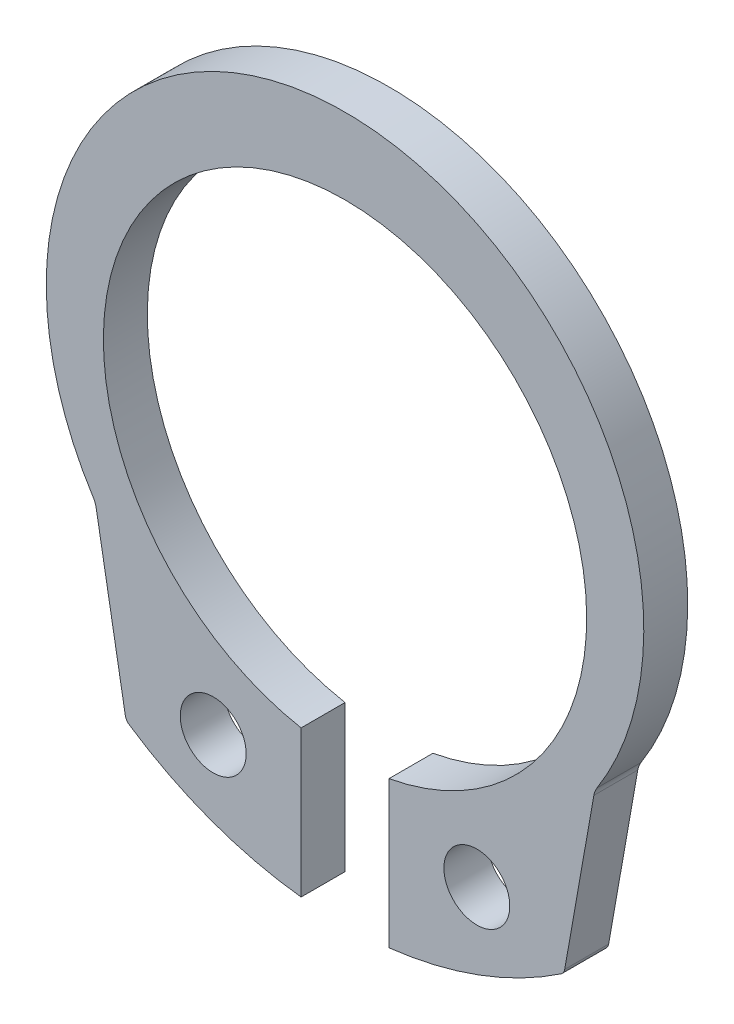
ISO-10303-21;
HEADER;
FILE_DESCRIPTION(('STEP AP214'),'2;1');
FILE_NAME('part.step','',(''),(''),'','','');
FILE_SCHEMA(('AUTOMOTIVE_DESIGN { 1 0 10303 214 1 1 1 1 }'));
ENDSEC;
DATA;
#1=APPLICATION_CONTEXT('core data for automotive mechanical design processes');
#2=APPLICATION_PROTOCOL_DEFINITION('international standard','automotive_design',2000,#1);
#3=PRODUCT_CONTEXT('',#1,'mechanical');
#4=PRODUCT('Part','Part','',(#3));
#5=PRODUCT_RELATED_PRODUCT_CATEGORY('part','',(#4));
#6=PRODUCT_DEFINITION_FORMATION('','',#4);
#7=PRODUCT_DEFINITION_CONTEXT('part definition',#1,'design');
#8=PRODUCT_DEFINITION('design','',#6,#7);
#9=PRODUCT_DEFINITION_SHAPE('','',#8);
#10=(LENGTH_UNIT() NAMED_UNIT(*) SI_UNIT(.MILLI.,.METRE.));
#11=(NAMED_UNIT(*) PLANE_ANGLE_UNIT() SI_UNIT($,.RADIAN.));
#12=(NAMED_UNIT(*) SI_UNIT($,.STERADIAN.) SOLID_ANGLE_UNIT());
#13=UNCERTAINTY_MEASURE_WITH_UNIT(LENGTH_MEASURE(1.E-05),#10,'distance_accuracy_value','');
#14=(GEOMETRIC_REPRESENTATION_CONTEXT(3) GLOBAL_UNCERTAINTY_ASSIGNED_CONTEXT((#13)) GLOBAL_UNIT_ASSIGNED_CONTEXT((#10,
#11,#12)) REPRESENTATION_CONTEXT('',''));
#15=CARTESIAN_POINT('',(0.,0.,0.));
#16=DIRECTION('',(0.,0.,1.));
#17=DIRECTION('',(1.,0.,0.));
#18=AXIS2_PLACEMENT_3D('',#15,#16,#17);
#19=CARTESIAN_POINT('',(-6.1556142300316,-3.92408122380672,0.5));
#20=DIRECTION('',(0.,0.,1.));
#21=DIRECTION('',(1.,0.,0.));
#22=AXIS2_PLACEMENT_3D('',#19,#20,#21);
#23=PLANE('',#22);
#24=CARTESIAN_POINT('',(-3.,-6.97522726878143,0.5));
#25=DIRECTION('',(0.,0.,1.));
#26=DIRECTION('',(1.,0.,0.));
#27=AXIS2_PLACEMENT_3D('',#24,#25,#26);
#28=CIRCLE('',#27,0.75);
#29=CARTESIAN_POINT('',(-2.25,-6.97522726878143,0.5));
#30=VERTEX_POINT('',#29);
#31=EDGE_CURVE('E188',#30,#30,#28,.T.);
#32=ORIENTED_EDGE('',*,*,#31,.F.);
#33=EDGE_LOOP('',(#32));
#34=FACE_BOUND('',#33,.T.);
#35=CARTESIAN_POINT('',(-6.1556142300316,-3.92408122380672,0.5));
#36=DIRECTION('',(0.,0.,-1.));
#37=DIRECTION('',(1.,0.,0.));
#38=AXIS2_PLACEMENT_3D('',#35,#36,#37);
#39=CIRCLE('',#38,0.5);
#40=CARTESIAN_POINT('',(-5.73399681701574,-3.65530853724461,0.5));
#41=VERTEX_POINT('',#40);
#42=CARTESIAN_POINT('',(-5.6632103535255,-3.83725713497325,0.5));
#43=VERTEX_POINT('',#42);
#44=EDGE_CURVE('E191',#41,#43,#39,.T.);
#45=ORIENTED_EDGE('',*,*,#44,.T.);
#46=DIRECTION('',(0.173648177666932,-0.984807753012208,0.));
#47=VECTOR('',#46,1.);
#48=CARTESIAN_POINT('',(-5.6632103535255,-3.83725713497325,0.5));
#49=LINE('',#48,#47);
#50=CARTESIAN_POINT('',(-5.,-7.59850995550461,0.5));
#51=VERTEX_POINT('',#50);
#52=EDGE_CURVE('E133',#43,#51,#49,.T.);
#53=ORIENTED_EDGE('',*,*,#52,.T.);
#54=CARTESIAN_POINT('',(-4.80303844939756,-7.56378031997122,0.5));
#55=DIRECTION('',(0.,0.,1.));
#56=DIRECTION('',(-1.,0.,0.));
#57=AXIS2_PLACEMENT_3D('',#54,#55,#56);
#58=CIRCLE('',#57,0.2);
#59=CARTESIAN_POINT('',(-4.9147370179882,-7.72968218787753,0.5));
#60=VERTEX_POINT('',#59);
#61=EDGE_CURVE('E194',#51,#60,#58,.T.);
#62=ORIENTED_EDGE('',*,*,#61,.T.);
#63=CARTESIAN_POINT('',(0.,-0.43,0.5));
#64=DIRECTION('',(0.,0.,1.));
#65=DIRECTION('',(-1.,0.,0.));
#66=AXIS2_PLACEMENT_3D('',#63,#64,#65);
#67=CIRCLE('',#66,8.8);
#68=CARTESIAN_POINT('',(-0.999999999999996,-9.17299719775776,0.5));
#69=VERTEX_POINT('',#68);
#70=EDGE_CURVE('E196',#60,#69,#67,.T.);
#71=ORIENTED_EDGE('',*,*,#70,.T.);
#72=DIRECTION('',(0.,1.,0.));
#73=VECTOR('',#72,1.);
#74=CARTESIAN_POINT('',(-1.,-5.83832691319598,0.5));
#75=LINE('',#74,#73);
#76=CARTESIAN_POINT('',(-1.,-5.83832691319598,0.5));
#77=VERTEX_POINT('',#76);
#78=EDGE_CURVE('E198',#69,#77,#75,.T.);
#79=ORIENTED_EDGE('',*,*,#78,.T.);
#80=CARTESIAN_POINT('',(0.,-0.43,0.5));
#81=DIRECTION('',(0.,0.,-1.));
#82=DIRECTION('',(1.,0.,0.));
#83=AXIS2_PLACEMENT_3D('',#80,#81,#82);
#84=CIRCLE('',#83,5.5);
#85=CARTESIAN_POINT('',(0.999999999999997,-5.83832691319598,0.5));
#86=VERTEX_POINT('',#85);
#87=EDGE_CURVE('E200',#77,#86,#84,.T.);
#88=ORIENTED_EDGE('',*,*,#87,.T.);
#89=DIRECTION('',(0.,-1.,0.));
#90=VECTOR('',#89,1.);
#91=CARTESIAN_POINT('',(1.,-5.83832691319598,0.5));
#92=LINE('',#91,#90);
#93=CARTESIAN_POINT('',(1.,-9.17299719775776,0.5));
#94=VERTEX_POINT('',#93);
#95=EDGE_CURVE('E202',#86,#94,#92,.T.);
#96=ORIENTED_EDGE('',*,*,#95,.T.);
#97=CARTESIAN_POINT('',(0.,-0.43,0.5));
#98=DIRECTION('',(0.,0.,1.));
#99=DIRECTION('',(1.,0.,0.));
#100=AXIS2_PLACEMENT_3D('',#97,#98,#99);
#101=CIRCLE('',#100,8.8);
#102=CARTESIAN_POINT('',(4.9147370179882,-7.72968218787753,0.5));
#103=VERTEX_POINT('',#102);
#104=EDGE_CURVE('E204',#94,#103,#101,.T.);
#105=ORIENTED_EDGE('',*,*,#104,.T.);
#106=CARTESIAN_POINT('',(4.80303844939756,-7.56378031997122,0.5));
#107=DIRECTION('',(0.,0.,1.));
#108=DIRECTION('',(1.,0.,0.));
#109=AXIS2_PLACEMENT_3D('',#106,#107,#108);
#110=CIRCLE('',#109,0.2);
#111=CARTESIAN_POINT('',(5.,-7.59850995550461,0.5));
#112=VERTEX_POINT('',#111);
#113=EDGE_CURVE('E206',#103,#112,#110,.T.);
#114=ORIENTED_EDGE('',*,*,#113,.T.);
#115=DIRECTION('',(0.173648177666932,0.984807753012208,0.));
#116=VECTOR('',#115,1.);
#117=CARTESIAN_POINT('',(5.6632103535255,-3.83725713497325,0.5));
#118=LINE('',#117,#116);
#119=CARTESIAN_POINT('',(5.6632103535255,-3.83725713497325,0.5));
#120=VERTEX_POINT('',#119);
#121=EDGE_CURVE('E208',#112,#120,#118,.T.);
#122=ORIENTED_EDGE('',*,*,#121,.T.);
#123=CARTESIAN_POINT('',(6.1556142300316,-3.92408122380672,0.5));
#124=DIRECTION('',(0.,0.,-1.));
#125=DIRECTION('',(-1.,0.,0.));
#126=AXIS2_PLACEMENT_3D('',#123,#124,#125);
#127=CIRCLE('',#126,0.5);
#128=CARTESIAN_POINT('',(5.73399681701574,-3.65530853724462,0.5));
#129=VERTEX_POINT('',#128);
#130=EDGE_CURVE('E61',#120,#129,#127,.T.);
#131=ORIENTED_EDGE('',*,*,#130,.T.);
#132=CARTESIAN_POINT('',(0.,0.,0.5));
#133=DIRECTION('',(0.,0.,1.));
#134=DIRECTION('',(1.,0.,0.));
#135=AXIS2_PLACEMENT_3D('',#132,#133,#134);
#136=CIRCLE('',#135,6.8);
#137=EDGE_CURVE('E56',#129,#41,#136,.T.);
#138=ORIENTED_EDGE('',*,*,#137,.T.);
#139=EDGE_LOOP('',(#45,#53,#62,#71,#79,#88,#96,#105,#114,#122,#131,#138));
#140=FACE_BOUND('',#139,.T.);
#141=CARTESIAN_POINT('',(3.,-6.97522726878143,0.5));
#142=DIRECTION('',(0.,0.,1.));
#143=DIRECTION('',(-1.,0.,0.));
#144=AXIS2_PLACEMENT_3D('',#141,#142,#143);
#145=CIRCLE('',#144,0.75);
#146=CARTESIAN_POINT('',(2.25,-6.97522726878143,0.5));
#147=VERTEX_POINT('',#146);
#148=EDGE_CURVE('E185',#147,#147,#145,.T.);
#149=ORIENTED_EDGE('',*,*,#148,.F.);
#150=EDGE_LOOP('',(#149));
#151=FACE_BOUND('',#150,.T.);
#152=ADVANCED_FACE('F41',(#34,#140,#151),#23,.T.);
#153=CARTESIAN_POINT('',(-6.1556142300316,-3.92408122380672,0.5));
#154=DIRECTION('',(0.,0.,-1.));
#155=DIRECTION('',(-1.,0.,0.));
#156=AXIS2_PLACEMENT_3D('',#153,#154,#155);
#157=CYLINDRICAL_SURFACE('',#156,0.5);
#158=DIRECTION('',(0.,0.,-1.));
#159=VECTOR('',#158,1.);
#160=CARTESIAN_POINT('',(-5.73399681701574,-3.65530853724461,0.5));
#161=LINE('',#160,#159);
#162=CARTESIAN_POINT('',(-5.73399681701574,-3.65530853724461,-0.5));
#163=VERTEX_POINT('',#162);
#164=EDGE_CURVE('E148',#41,#163,#161,.T.);
#165=ORIENTED_EDGE('',*,*,#164,.T.);
#166=CARTESIAN_POINT('',(-6.1556142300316,-3.92408122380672,-0.5));
#167=DIRECTION('',(0.,0.,-1.));
#168=DIRECTION('',(1.,0.,0.));
#169=AXIS2_PLACEMENT_3D('',#166,#167,#168);
#170=CIRCLE('',#169,0.5);
#171=CARTESIAN_POINT('',(-5.6632103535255,-3.83725713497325,-0.5));
#172=VERTEX_POINT('',#171);
#173=EDGE_CURVE('E142',#163,#172,#170,.T.);
#174=ORIENTED_EDGE('',*,*,#173,.T.);
#175=DIRECTION('',(0.,0.,-1.));
#176=VECTOR('',#175,1.);
#177=CARTESIAN_POINT('',(-5.6632103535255,-3.83725713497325,0.5));
#178=LINE('',#177,#176);
#179=EDGE_CURVE('E11',#43,#172,#178,.T.);
#180=ORIENTED_EDGE('',*,*,#179,.F.);
#181=ORIENTED_EDGE('',*,*,#44,.F.);
#182=EDGE_LOOP('',(#165,#174,#180,#181));
#183=FACE_BOUND('',#182,.T.);
#184=ADVANCED_FACE('F43',(#183),#157,.F.);
#185=CARTESIAN_POINT('',(-5.6632103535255,-3.83725713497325,0.5));
#186=DIRECTION('',(0.984807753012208,0.173648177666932,0.));
#187=DIRECTION('',(-0.173648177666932,0.984807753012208,0.));
#188=AXIS2_PLACEMENT_3D('',#185,#186,#187);
#189=PLANE('',#188);
#190=ORIENTED_EDGE('',*,*,#179,.T.);
#191=DIRECTION('',(0.173648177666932,-0.984807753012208,0.));
#192=VECTOR('',#191,1.);
#193=CARTESIAN_POINT('',(-5.6632103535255,-3.83725713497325,-0.5));
#194=LINE('',#193,#192);
#195=CARTESIAN_POINT('',(-5.,-7.59850995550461,-0.5));
#196=VERTEX_POINT('',#195);
#197=EDGE_CURVE('E132',#172,#196,#194,.T.);
#198=ORIENTED_EDGE('',*,*,#197,.T.);
#199=DIRECTION('',(0.,0.,-1.));
#200=VECTOR('',#199,1.);
#201=CARTESIAN_POINT('',(-5.,-7.59850995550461,0.5));
#202=LINE('',#201,#200);
#203=EDGE_CURVE('E49',#51,#196,#202,.T.);
#204=ORIENTED_EDGE('',*,*,#203,.F.);
#205=ORIENTED_EDGE('',*,*,#52,.F.);
#206=EDGE_LOOP('',(#190,#198,#204,#205));
#207=FACE_BOUND('',#206,.T.);
#208=ADVANCED_FACE('F130',(#207),#189,.F.);
#209=CARTESIAN_POINT('',(-4.80303844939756,-7.56378031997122,0.5));
#210=DIRECTION('',(0.,0.,-1.));
#211=DIRECTION('',(-1.,0.,0.));
#212=AXIS2_PLACEMENT_3D('',#209,#210,#211);
#213=CYLINDRICAL_SURFACE('',#212,0.2);
#214=ORIENTED_EDGE('',*,*,#203,.T.);
#215=CARTESIAN_POINT('',(-4.80303844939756,-7.56378031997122,-0.5));
#216=DIRECTION('',(0.,0.,1.));
#217=DIRECTION('',(-1.,0.,0.));
#218=AXIS2_PLACEMENT_3D('',#215,#216,#217);
#219=CIRCLE('',#218,0.2);
#220=CARTESIAN_POINT('',(-4.9147370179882,-7.72968218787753,-0.5));
#221=VERTEX_POINT('',#220);
#222=EDGE_CURVE('E146',#196,#221,#219,.T.);
#223=ORIENTED_EDGE('',*,*,#222,.T.);
#224=DIRECTION('',(0.,0.,-1.));
#225=VECTOR('',#224,1.);
#226=CARTESIAN_POINT('',(-4.9147370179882,-7.72968218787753,0.5));
#227=LINE('',#226,#225);
#228=EDGE_CURVE('E230',#60,#221,#227,.T.);
#229=ORIENTED_EDGE('',*,*,#228,.F.);
#230=ORIENTED_EDGE('',*,*,#61,.F.);
#231=EDGE_LOOP('',(#214,#223,#229,#230));
#232=FACE_BOUND('',#231,.T.);
#233=ADVANCED_FACE('F233',(#232),#213,.T.);
#234=CARTESIAN_POINT('',(0.,-0.43,0.5));
#235=DIRECTION('',(0.,0.,-1.));
#236=DIRECTION('',(-1.,0.,0.));
#237=AXIS2_PLACEMENT_3D('',#234,#235,#236);
#238=CYLINDRICAL_SURFACE('',#237,8.8);
#239=ORIENTED_EDGE('',*,*,#228,.T.);
#240=CARTESIAN_POINT('',(0.,-0.43,-0.5));
#241=DIRECTION('',(0.,0.,1.));
#242=DIRECTION('',(-1.,0.,0.));
#243=AXIS2_PLACEMENT_3D('',#240,#241,#242);
#244=CIRCLE('',#243,8.8);
#245=CARTESIAN_POINT('',(-0.999999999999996,-9.17299719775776,-0.5));
#246=VERTEX_POINT('',#245);
#247=EDGE_CURVE('E157',#221,#246,#244,.T.);
#248=ORIENTED_EDGE('',*,*,#247,.T.);
#249=DIRECTION('',(0.,0.,-1.));
#250=VECTOR('',#249,1.);
#251=CARTESIAN_POINT('',(-0.999999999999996,-9.17299719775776,0.5));
#252=LINE('',#251,#250);
#253=EDGE_CURVE('E228',#69,#246,#252,.T.);
#254=ORIENTED_EDGE('',*,*,#253,.F.);
#255=ORIENTED_EDGE('',*,*,#70,.F.);
#256=EDGE_LOOP('',(#239,#248,#254,#255));
#257=FACE_BOUND('',#256,.T.);
#258=ADVANCED_FACE('F241',(#257),#238,.T.);
#259=CARTESIAN_POINT('',(-1.,-5.83832691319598,0.5));
#260=DIRECTION('',(-1.,0.,0.));
#261=DIRECTION('',(0.,-1.,0.));
#262=AXIS2_PLACEMENT_3D('',#259,#260,#261);
#263=PLANE('',#262);
#264=ORIENTED_EDGE('',*,*,#253,.T.);
#265=DIRECTION('',(0.,1.,0.));
#266=VECTOR('',#265,1.);
#267=CARTESIAN_POINT('',(-1.,-5.83832691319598,-0.5));
#268=LINE('',#267,#266);
#269=CARTESIAN_POINT('',(-1.,-5.83832691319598,-0.5));
#270=VERTEX_POINT('',#269);
#271=EDGE_CURVE('E160',#246,#270,#268,.T.);
#272=ORIENTED_EDGE('',*,*,#271,.T.);
#273=DIRECTION('',(0.,0.,-1.));
#274=VECTOR('',#273,1.);
#275=CARTESIAN_POINT('',(-1.,-5.83832691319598,0.5));
#276=LINE('',#275,#274);
#277=EDGE_CURVE('E226',#77,#270,#276,.T.);
#278=ORIENTED_EDGE('',*,*,#277,.F.);
#279=ORIENTED_EDGE('',*,*,#78,.F.);
#280=EDGE_LOOP('',(#264,#272,#278,#279));
#281=FACE_BOUND('',#280,.T.);
#282=ADVANCED_FACE('F244',(#281),#263,.F.);
#283=CARTESIAN_POINT('',(0.,-0.43,0.5));
#284=DIRECTION('',(0.,0.,-1.));
#285=DIRECTION('',(-1.,0.,0.));
#286=AXIS2_PLACEMENT_3D('',#283,#284,#285);
#287=CYLINDRICAL_SURFACE('',#286,5.5);
#288=ORIENTED_EDGE('',*,*,#277,.T.);
#289=CARTESIAN_POINT('',(0.,-0.43,-0.5));
#290=DIRECTION('',(0.,0.,-1.));
#291=DIRECTION('',(1.,0.,0.));
#292=AXIS2_PLACEMENT_3D('',#289,#290,#291);
#293=CIRCLE('',#292,5.5);
#294=CARTESIAN_POINT('',(0.999999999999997,-5.83832691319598,-0.5));
#295=VERTEX_POINT('',#294);
#296=EDGE_CURVE('E163',#270,#295,#293,.T.);
#297=ORIENTED_EDGE('',*,*,#296,.T.);
#298=DIRECTION('',(0.,0.,-1.));
#299=VECTOR('',#298,1.);
#300=CARTESIAN_POINT('',(0.999999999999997,-5.83832691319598,0.5));
#301=LINE('',#300,#299);
#302=EDGE_CURVE('E224',#86,#295,#301,.T.);
#303=ORIENTED_EDGE('',*,*,#302,.F.);
#304=ORIENTED_EDGE('',*,*,#87,.F.);
#305=EDGE_LOOP('',(#288,#297,#303,#304));
#306=FACE_BOUND('',#305,.T.);
#307=ADVANCED_FACE('F249',(#306),#287,.F.);
#308=CARTESIAN_POINT('',(1.,-5.83832691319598,0.5));
#309=DIRECTION('',(1.,0.,0.));
#310=DIRECTION('',(0.,1.,0.));
#311=AXIS2_PLACEMENT_3D('',#308,#309,#310);
#312=PLANE('',#311);
#313=ORIENTED_EDGE('',*,*,#302,.T.);
#314=DIRECTION('',(0.,-1.,0.));
#315=VECTOR('',#314,1.);
#316=CARTESIAN_POINT('',(1.,-5.83832691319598,-0.5));
#317=LINE('',#316,#315);
#318=CARTESIAN_POINT('',(1.,-9.17299719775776,-0.5));
#319=VERTEX_POINT('',#318);
#320=EDGE_CURVE('E167',#295,#319,#317,.T.);
#321=ORIENTED_EDGE('',*,*,#320,.T.);
#322=DIRECTION('',(0.,0.,-1.));
#323=VECTOR('',#322,1.);
#324=CARTESIAN_POINT('',(1.,-9.17299719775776,0.5));
#325=LINE('',#324,#323);
#326=EDGE_CURVE('E222',#94,#319,#325,.T.);
#327=ORIENTED_EDGE('',*,*,#326,.F.);
#328=ORIENTED_EDGE('',*,*,#95,.F.);
#329=EDGE_LOOP('',(#313,#321,#327,#328));
#330=FACE_BOUND('',#329,.T.);
#331=ADVANCED_FACE('F255',(#330),#312,.F.);
#332=CARTESIAN_POINT('',(0.,-0.43,0.5));
#333=DIRECTION('',(0.,0.,-1.));
#334=DIRECTION('',(-1.,0.,0.));
#335=AXIS2_PLACEMENT_3D('',#332,#333,#334);
#336=CYLINDRICAL_SURFACE('',#335,8.8);
#337=ORIENTED_EDGE('',*,*,#326,.T.);
#338=CARTESIAN_POINT('',(0.,-0.43,-0.5));
#339=DIRECTION('',(0.,0.,1.));
#340=DIRECTION('',(1.,0.,0.));
#341=AXIS2_PLACEMENT_3D('',#338,#339,#340);
#342=CIRCLE('',#341,8.8);
#343=CARTESIAN_POINT('',(4.9147370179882,-7.72968218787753,-0.5));
#344=VERTEX_POINT('',#343);
#345=EDGE_CURVE('E170',#319,#344,#342,.T.);
#346=ORIENTED_EDGE('',*,*,#345,.T.);
#347=DIRECTION('',(0.,0.,-1.));
#348=VECTOR('',#347,1.);
#349=CARTESIAN_POINT('',(4.9147370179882,-7.72968218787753,0.5));
#350=LINE('',#349,#348);
#351=EDGE_CURVE('E220',#103,#344,#350,.T.);
#352=ORIENTED_EDGE('',*,*,#351,.F.);
#353=ORIENTED_EDGE('',*,*,#104,.F.);
#354=EDGE_LOOP('',(#337,#346,#352,#353));
#355=FACE_BOUND('',#354,.T.);
#356=ADVANCED_FACE('F259',(#355),#336,.T.);
#357=CARTESIAN_POINT('',(4.80303844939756,-7.56378031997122,0.5));
#358=DIRECTION('',(0.,0.,-1.));
#359=DIRECTION('',(-1.,0.,0.));
#360=AXIS2_PLACEMENT_3D('',#357,#358,#359);
#361=CYLINDRICAL_SURFACE('',#360,0.2);
#362=ORIENTED_EDGE('',*,*,#351,.T.);
#363=CARTESIAN_POINT('',(4.80303844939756,-7.56378031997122,-0.5));
#364=DIRECTION('',(0.,0.,1.));
#365=DIRECTION('',(1.,0.,0.));
#366=AXIS2_PLACEMENT_3D('',#363,#364,#365);
#367=CIRCLE('',#366,0.2);
#368=CARTESIAN_POINT('',(5.,-7.59850995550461,-0.5));
#369=VERTEX_POINT('',#368);
#370=EDGE_CURVE('E173',#344,#369,#367,.T.);
#371=ORIENTED_EDGE('',*,*,#370,.T.);
#372=DIRECTION('',(0.,0.,-1.));
#373=VECTOR('',#372,1.);
#374=CARTESIAN_POINT('',(5.,-7.59850995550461,0.5));
#375=LINE('',#374,#373);
#376=EDGE_CURVE('E218',#112,#369,#375,.T.);
#377=ORIENTED_EDGE('',*,*,#376,.F.);
#378=ORIENTED_EDGE('',*,*,#113,.F.);
#379=EDGE_LOOP('',(#362,#371,#377,#378));
#380=FACE_BOUND('',#379,.T.);
#381=ADVANCED_FACE('F264',(#380),#361,.T.);
#382=CARTESIAN_POINT('',(5.6632103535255,-3.83725713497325,0.5));
#383=DIRECTION('',(-0.984807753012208,0.173648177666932,0.));
#384=DIRECTION('',(-0.173648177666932,-0.984807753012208,0.));
#385=AXIS2_PLACEMENT_3D('',#382,#383,#384);
#386=PLANE('',#385);
#387=ORIENTED_EDGE('',*,*,#376,.T.);
#388=DIRECTION('',(0.173648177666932,0.984807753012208,0.));
#389=VECTOR('',#388,1.);
#390=CARTESIAN_POINT('',(5.6632103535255,-3.83725713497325,-0.5));
#391=LINE('',#390,#389);
#392=CARTESIAN_POINT('',(5.6632103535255,-3.83725713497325,-0.5));
#393=VERTEX_POINT('',#392);
#394=EDGE_CURVE('E176',#369,#393,#391,.T.);
#395=ORIENTED_EDGE('',*,*,#394,.T.);
#396=DIRECTION('',(0.,0.,-1.));
#397=VECTOR('',#396,1.);
#398=CARTESIAN_POINT('',(5.6632103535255,-3.83725713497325,0.5));
#399=LINE('',#398,#397);
#400=EDGE_CURVE('E216',#120,#393,#399,.T.);
#401=ORIENTED_EDGE('',*,*,#400,.F.);
#402=ORIENTED_EDGE('',*,*,#121,.F.);
#403=EDGE_LOOP('',(#387,#395,#401,#402));
#404=FACE_BOUND('',#403,.T.);
#405=ADVANCED_FACE('F268',(#404),#386,.F.);
#406=CARTESIAN_POINT('',(6.1556142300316,-3.92408122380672,0.5));
#407=DIRECTION('',(0.,0.,-1.));
#408=DIRECTION('',(-1.,0.,0.));
#409=AXIS2_PLACEMENT_3D('',#406,#407,#408);
#410=CYLINDRICAL_SURFACE('',#409,0.5);
#411=ORIENTED_EDGE('',*,*,#400,.T.);
#412=CARTESIAN_POINT('',(6.1556142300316,-3.92408122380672,-0.5));
#413=DIRECTION('',(0.,0.,-1.));
#414=DIRECTION('',(-1.,0.,0.));
#415=AXIS2_PLACEMENT_3D('',#412,#413,#414);
#416=CIRCLE('',#415,0.5);
#417=CARTESIAN_POINT('',(5.73399681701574,-3.65530853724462,-0.5));
#418=VERTEX_POINT('',#417);
#419=EDGE_CURVE('E179',#393,#418,#416,.T.);
#420=ORIENTED_EDGE('',*,*,#419,.T.);
#421=DIRECTION('',(0.,0.,-1.));
#422=VECTOR('',#421,1.);
#423=CARTESIAN_POINT('',(5.73399681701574,-3.65530853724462,0.5));
#424=LINE('',#423,#422);
#425=EDGE_CURVE('E214',#129,#418,#424,.T.);
#426=ORIENTED_EDGE('',*,*,#425,.F.);
#427=ORIENTED_EDGE('',*,*,#130,.F.);
#428=EDGE_LOOP('',(#411,#420,#426,#427));
#429=FACE_BOUND('',#428,.T.);
#430=ADVANCED_FACE('F272',(#429),#410,.F.);
#431=CARTESIAN_POINT('',(0.,0.,0.5));
#432=DIRECTION('',(0.,0.,-1.));
#433=DIRECTION('',(-1.,0.,0.));
#434=AXIS2_PLACEMENT_3D('',#431,#432,#433);
#435=CYLINDRICAL_SURFACE('',#434,6.8);
#436=ORIENTED_EDGE('',*,*,#425,.T.);
#437=CARTESIAN_POINT('',(0.,0.,-0.5));
#438=DIRECTION('',(0.,0.,1.));
#439=DIRECTION('',(1.,0.,0.));
#440=AXIS2_PLACEMENT_3D('',#437,#438,#439);
#441=CIRCLE('',#440,6.8);
#442=EDGE_CURVE('E182',#418,#163,#441,.T.);
#443=ORIENTED_EDGE('',*,*,#442,.T.);
#444=ORIENTED_EDGE('',*,*,#164,.F.);
#445=ORIENTED_EDGE('',*,*,#137,.F.);
#446=EDGE_LOOP('',(#436,#443,#444,#445));
#447=FACE_BOUND('',#446,.T.);
#448=ADVANCED_FACE('F274',(#447),#435,.T.);
#449=CARTESIAN_POINT('',(-3.,-6.97522726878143,0.5));
#450=DIRECTION('',(0.,0.,-1.));
#451=DIRECTION('',(-1.,0.,0.));
#452=AXIS2_PLACEMENT_3D('',#449,#450,#451);
#453=CYLINDRICAL_SURFACE('',#452,0.75);
#454=ORIENTED_EDGE('',*,*,#31,.T.);
#455=EDGE_LOOP('',(#454));
#456=FACE_BOUND('',#455,.T.);
#457=CARTESIAN_POINT('',(-3.,-6.97522726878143,-0.5));
#458=DIRECTION('',(0.,0.,1.));
#459=DIRECTION('',(1.,0.,0.));
#460=AXIS2_PLACEMENT_3D('',#457,#458,#459);
#461=CIRCLE('',#460,0.75);
#462=CARTESIAN_POINT('',(-2.25,-6.97522726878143,-0.5));
#463=VERTEX_POINT('',#462);
#464=EDGE_CURVE('E149',#463,#463,#461,.T.);
#465=ORIENTED_EDGE('',*,*,#464,.F.);
#466=EDGE_LOOP('',(#465));
#467=FACE_BOUND('',#466,.T.);
#468=ADVANCED_FACE('F276',(#456,#467),#453,.F.);
#469=CARTESIAN_POINT('',(3.,-6.97522726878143,0.5));
#470=DIRECTION('',(0.,0.,-1.));
#471=DIRECTION('',(-1.,0.,0.));
#472=AXIS2_PLACEMENT_3D('',#469,#470,#471);
#473=CYLINDRICAL_SURFACE('',#472,0.75);
#474=ORIENTED_EDGE('',*,*,#148,.T.);
#475=EDGE_LOOP('',(#474));
#476=FACE_BOUND('',#475,.T.);
#477=CARTESIAN_POINT('',(3.,-6.97522726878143,-0.5));
#478=DIRECTION('',(0.,0.,1.));
#479=DIRECTION('',(-1.,0.,0.));
#480=AXIS2_PLACEMENT_3D('',#477,#478,#479);
#481=CIRCLE('',#480,0.75);
#482=CARTESIAN_POINT('',(2.25,-6.97522726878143,-0.5));
#483=VERTEX_POINT('',#482);
#484=EDGE_CURVE('E152',#483,#483,#481,.T.);
#485=ORIENTED_EDGE('',*,*,#484,.F.);
#486=EDGE_LOOP('',(#485));
#487=FACE_BOUND('',#486,.T.);
#488=ADVANCED_FACE('F282',(#476,#487),#473,.F.);
#489=CARTESIAN_POINT('',(-6.1556142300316,-3.92408122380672,-0.5));
#490=DIRECTION('',(0.,0.,1.));
#491=DIRECTION('',(1.,0.,0.));
#492=AXIS2_PLACEMENT_3D('',#489,#490,#491);
#493=PLANE('',#492);
#494=ORIENTED_EDGE('',*,*,#484,.T.);
#495=EDGE_LOOP('',(#494));
#496=FACE_BOUND('',#495,.T.);
#497=ORIENTED_EDGE('',*,*,#464,.T.);
#498=EDGE_LOOP('',(#497));
#499=FACE_BOUND('',#498,.T.);
#500=ORIENTED_EDGE('',*,*,#173,.F.);
#501=ORIENTED_EDGE('',*,*,#442,.F.);
#502=ORIENTED_EDGE('',*,*,#419,.F.);
#503=ORIENTED_EDGE('',*,*,#394,.F.);
#504=ORIENTED_EDGE('',*,*,#370,.F.);
#505=ORIENTED_EDGE('',*,*,#345,.F.);
#506=ORIENTED_EDGE('',*,*,#320,.F.);
#507=ORIENTED_EDGE('',*,*,#296,.F.);
#508=ORIENTED_EDGE('',*,*,#271,.F.);
#509=ORIENTED_EDGE('',*,*,#247,.F.);
#510=ORIENTED_EDGE('',*,*,#222,.F.);
#511=ORIENTED_EDGE('',*,*,#197,.F.);
#512=EDGE_LOOP('',(#500,#501,#502,#503,#504,#505,#506,#507,#508,#509,#510,#511));
#513=FACE_BOUND('',#512,.T.);
#514=ADVANCED_FACE('F140',(#496,#499,#513),#493,.F.);
#515=CLOSED_SHELL('',(#152,#184,#208,#233,#258,#282,#307,#331,#356,#381,#405,#430,#448,#468,
#488,#514));
#516=MANIFOLD_SOLID_BREP('B2',#515);
#517=ADVANCED_BREP_SHAPE_REPRESENTATION('',(#18,#516),#14);
#518=SHAPE_DEFINITION_REPRESENTATION(#9,#517);
ENDSEC;
END-ISO-10303-21;
